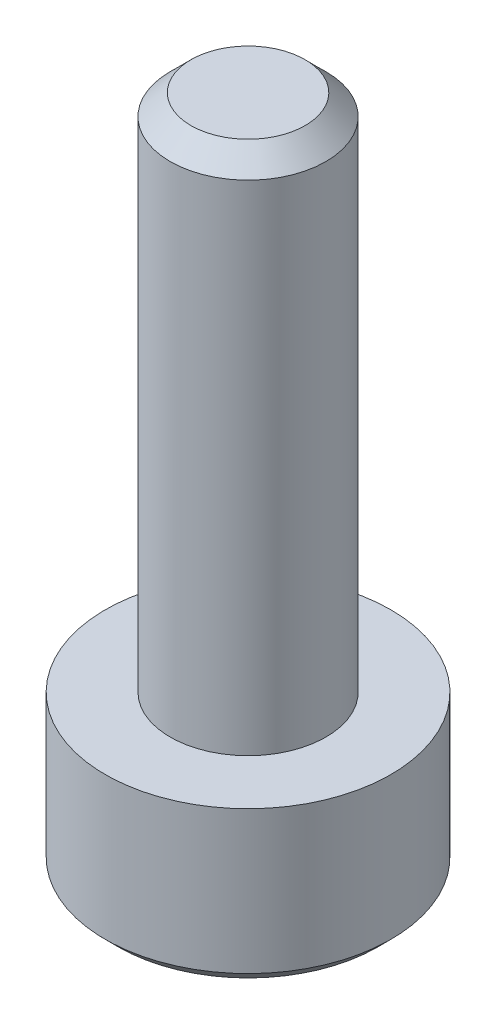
from build123d import *

# Parameters (mm, degrees)
CHANFREIN_FILETAGE_SIZE = 0.4
F_6_PANS_DEPTH          = 2.5
CHANFREIN_T_TE_SIZE     = 0.25


with BuildPart() as part:
    # Esquisse1 → Base-R_volution (revolve)
    with BuildSketch(Plane.XY, mode=Mode.PRIVATE) as base_r_volution_sk:
        Polygon((0, 0), (-2.75, 0), (-2.75, 3), (-1.5, 3), (-1.5, 13), (0, 13), align=None)
    revolve(base_r_volution_sk.sketch.rotate(Axis((0, -0.731448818, 0), (0, 1, 0)), 270), axis=Axis((0, -0.731448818, 0), (0, 1, 0)))

    # Chanfrein filetage
    chanfrein_filetage_edges = [part.edges().sort_by_distance(p)[0] for p in [
        (0, 13, 1.5),
    ]]
    chamfer(chanfrein_filetage_edges, length=CHANFREIN_FILETAGE_SIZE)

    # Esquisse2 → 6 pans (cut)
    with BuildSketch(Plane.XZ):
        Polygon((1.550844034, 0), (0.829156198, 1.25), (-0.614219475, 1.25), (-1.335907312, 0), (-0.614219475, -1.25), (0.829156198, -1.25), align=None)
    extrude(amount=-F_6_PANS_DEPTH, mode=Mode.SUBTRACT)

    # Chanfrein t_te
    chanfrein_t_te_edges = [part.edges().sort_by_distance(p)[0] for p in [
        (0, 0, 2.75),
    ]]
    chamfer(chanfrein_t_te_edges, length=CHANFREIN_T_TE_SIZE)


solid = part.part
